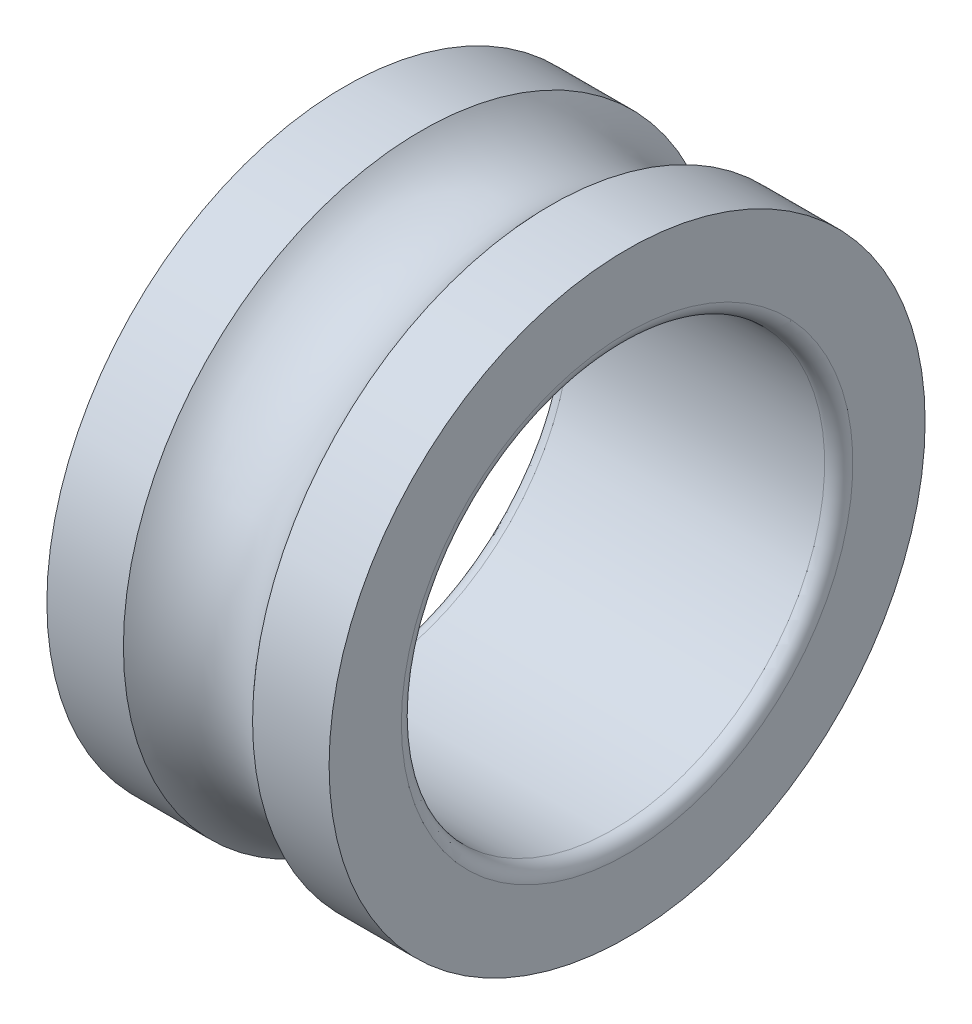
ISO-10303-21;
HEADER;
FILE_DESCRIPTION(('STEP AP214'),'2;1');
FILE_NAME('part.step','',(''),(''),'','','');
FILE_SCHEMA(('AUTOMOTIVE_DESIGN { 1 0 10303 214 1 1 1 1 }'));
ENDSEC;
DATA;
#1=APPLICATION_CONTEXT('core data for automotive mechanical design processes');
#2=APPLICATION_PROTOCOL_DEFINITION('international standard','automotive_design',2000,#1);
#3=PRODUCT_CONTEXT('',#1,'mechanical');
#4=PRODUCT('Part','Part','',(#3));
#5=PRODUCT_RELATED_PRODUCT_CATEGORY('part','',(#4));
#6=PRODUCT_DEFINITION_FORMATION('','',#4);
#7=PRODUCT_DEFINITION_CONTEXT('part definition',#1,'design');
#8=PRODUCT_DEFINITION('design','',#6,#7);
#9=PRODUCT_DEFINITION_SHAPE('','',#8);
#10=(LENGTH_UNIT() NAMED_UNIT(*) SI_UNIT(.MILLI.,.METRE.));
#11=(NAMED_UNIT(*) PLANE_ANGLE_UNIT() SI_UNIT($,.RADIAN.));
#12=(NAMED_UNIT(*) SI_UNIT($,.STERADIAN.) SOLID_ANGLE_UNIT());
#13=UNCERTAINTY_MEASURE_WITH_UNIT(LENGTH_MEASURE(1.E-05),#10,'distance_accuracy_value','');
#14=(GEOMETRIC_REPRESENTATION_CONTEXT(3) GLOBAL_UNCERTAINTY_ASSIGNED_CONTEXT((#13)) GLOBAL_UNIT_ASSIGNED_CONTEXT((#10,
#11,#12)) REPRESENTATION_CONTEXT('',''));
#15=CARTESIAN_POINT('',(0.,0.,0.));
#16=DIRECTION('',(0.,0.,1.));
#17=DIRECTION('',(1.,0.,0.));
#18=AXIS2_PLACEMENT_3D('',#15,#16,#17);
#19=CARTESIAN_POINT('',(8.,0.,0.));
#20=DIRECTION('',(-1.,0.,0.));
#21=DIRECTION('',(0.,0.,1.));
#22=AXIS2_PLACEMENT_3D('',#19,#20,#21);
#23=CYLINDRICAL_SURFACE('',#22,8.448);
#24=CARTESIAN_POINT('',(0.,0.,0.));
#25=DIRECTION('',(-1.,0.,0.));
#26=DIRECTION('',(0.,0.,1.));
#27=AXIS2_PLACEMENT_3D('',#24,#25,#26);
#28=CIRCLE('',#27,8.448);
#29=CARTESIAN_POINT('',(0.,0.,8.448));
#30=VERTEX_POINT('',#29);
#31=EDGE_CURVE('E10',#30,#30,#28,.T.);
#32=ORIENTED_EDGE('',*,*,#31,.F.);
#33=EDGE_LOOP('',(#32));
#34=FACE_BOUND('',#33,.T.);
#35=CARTESIAN_POINT('',(2.16934547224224,0.,0.));
#36=DIRECTION('',(-1.,0.,0.));
#37=DIRECTION('',(0.,0.,1.));
#38=AXIS2_PLACEMENT_3D('',#35,#36,#37);
#39=CIRCLE('',#38,8.448);
#40=CARTESIAN_POINT('',(2.16934547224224,0.,8.448));
#41=VERTEX_POINT('',#40);
#42=EDGE_CURVE('E56',#41,#41,#39,.T.);
#43=ORIENTED_EDGE('',*,*,#42,.T.);
#44=EDGE_LOOP('',(#43));
#45=FACE_BOUND('',#44,.T.);
#46=ADVANCED_FACE('F28',(#34,#45),#23,.T.);
#47=CARTESIAN_POINT('',(0.,8.448,0.));
#48=DIRECTION('',(1.,0.,0.));
#49=DIRECTION('',(0.,0.,-1.));
#50=AXIS2_PLACEMENT_3D('',#47,#48,#49);
#51=PLANE('',#50);
#52=CARTESIAN_POINT('',(0.,0.,0.));
#53=DIRECTION('',(-1.,0.,0.));
#54=DIRECTION('',(0.,0.,1.));
#55=AXIS2_PLACEMENT_3D('',#52,#53,#54);
#56=CIRCLE('',#55,6.4);
#57=CARTESIAN_POINT('',(0.,0.,6.4));
#58=VERTEX_POINT('',#57);
#59=EDGE_CURVE('E34',#58,#58,#56,.T.);
#60=ORIENTED_EDGE('',*,*,#59,.F.);
#61=EDGE_LOOP('',(#60));
#62=FACE_BOUND('',#61,.T.);
#63=ORIENTED_EDGE('',*,*,#31,.T.);
#64=EDGE_LOOP('',(#63));
#65=FACE_BOUND('',#64,.T.);
#66=ADVANCED_FACE('F93',(#62,#65),#51,.F.);
#67=CARTESIAN_POINT('',(0.399999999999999,0.,0.));
#68=DIRECTION('',(-1.,0.,0.));
#69=DIRECTION('',(0.,0.,1.));
#70=AXIS2_PLACEMENT_3D('',#67,#68,#69);
#71=TOROIDAL_SURFACE('',#70,6.4,0.399999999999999);
#72=CARTESIAN_POINT('',(0.399999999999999,0.,0.));
#73=DIRECTION('',(-1.,0.,0.));
#74=DIRECTION('',(0.,0.,1.));
#75=AXIS2_PLACEMENT_3D('',#72,#73,#74);
#76=CIRCLE('',#75,6.);
#77=CARTESIAN_POINT('',(0.399999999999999,0.,6.));
#78=VERTEX_POINT('',#77);
#79=EDGE_CURVE('E38',#78,#78,#76,.T.);
#80=ORIENTED_EDGE('',*,*,#79,.F.);
#81=EDGE_LOOP('',(#80));
#82=FACE_BOUND('',#81,.T.);
#83=ORIENTED_EDGE('',*,*,#59,.T.);
#84=EDGE_LOOP('',(#83));
#85=FACE_BOUND('',#84,.T.);
#86=ADVANCED_FACE('F88',(#82,#85),#71,.T.);
#87=CARTESIAN_POINT('',(8.,0.,0.));
#88=DIRECTION('',(-1.,0.,0.));
#89=DIRECTION('',(0.,0.,1.));
#90=AXIS2_PLACEMENT_3D('',#87,#88,#89);
#91=CYLINDRICAL_SURFACE('',#90,6.);
#92=CARTESIAN_POINT('',(7.6,0.,0.));
#93=DIRECTION('',(-1.,0.,0.));
#94=DIRECTION('',(0.,0.,1.));
#95=AXIS2_PLACEMENT_3D('',#92,#93,#94);
#96=CIRCLE('',#95,6.);
#97=CARTESIAN_POINT('',(7.6,0.,6.));
#98=VERTEX_POINT('',#97);
#99=EDGE_CURVE('E42',#98,#98,#96,.T.);
#100=ORIENTED_EDGE('',*,*,#99,.F.);
#101=EDGE_LOOP('',(#100));
#102=FACE_BOUND('',#101,.T.);
#103=ORIENTED_EDGE('',*,*,#79,.T.);
#104=EDGE_LOOP('',(#103));
#105=FACE_BOUND('',#104,.T.);
#106=ADVANCED_FACE('F82',(#102,#105),#91,.F.);
#107=CARTESIAN_POINT('',(7.6,0.,0.));
#108=DIRECTION('',(-1.,0.,0.));
#109=DIRECTION('',(0.,0.,1.));
#110=AXIS2_PLACEMENT_3D('',#107,#108,#109);
#111=TOROIDAL_SURFACE('',#110,6.4,0.400000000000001);
#112=CARTESIAN_POINT('',(8.,0.,0.));
#113=DIRECTION('',(-1.,0.,0.));
#114=DIRECTION('',(0.,0.,1.));
#115=AXIS2_PLACEMENT_3D('',#112,#113,#114);
#116=CIRCLE('',#115,6.4);
#117=CARTESIAN_POINT('',(8.,0.,6.4));
#118=VERTEX_POINT('',#117);
#119=EDGE_CURVE('E47',#118,#118,#116,.T.);
#120=ORIENTED_EDGE('',*,*,#119,.F.);
#121=EDGE_LOOP('',(#120));
#122=FACE_BOUND('',#121,.T.);
#123=ORIENTED_EDGE('',*,*,#99,.T.);
#124=EDGE_LOOP('',(#123));
#125=FACE_BOUND('',#124,.T.);
#126=ADVANCED_FACE('F76',(#122,#125),#111,.T.);
#127=CARTESIAN_POINT('',(8.,6.4,0.));
#128=DIRECTION('',(-1.,0.,0.));
#129=DIRECTION('',(0.,0.,1.));
#130=AXIS2_PLACEMENT_3D('',#127,#128,#129);
#131=PLANE('',#130);
#132=CARTESIAN_POINT('',(8.,0.,0.));
#133=DIRECTION('',(-1.,0.,0.));
#134=DIRECTION('',(0.,0.,1.));
#135=AXIS2_PLACEMENT_3D('',#132,#133,#134);
#136=CIRCLE('',#135,8.448);
#137=CARTESIAN_POINT('',(8.,0.,8.448));
#138=VERTEX_POINT('',#137);
#139=EDGE_CURVE('E50',#138,#138,#136,.T.);
#140=ORIENTED_EDGE('',*,*,#139,.F.);
#141=EDGE_LOOP('',(#140));
#142=FACE_BOUND('',#141,.T.);
#143=ORIENTED_EDGE('',*,*,#119,.T.);
#144=EDGE_LOOP('',(#143));
#145=FACE_BOUND('',#144,.T.);
#146=ADVANCED_FACE('F70',(#142,#145),#131,.F.);
#147=CARTESIAN_POINT('',(8.,0.,0.));
#148=DIRECTION('',(-1.,0.,0.));
#149=DIRECTION('',(0.,0.,1.));
#150=AXIS2_PLACEMENT_3D('',#147,#148,#149);
#151=CYLINDRICAL_SURFACE('',#150,8.448);
#152=CARTESIAN_POINT('',(5.83065452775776,0.,0.));
#153=DIRECTION('',(-1.,0.,0.));
#154=DIRECTION('',(0.,0.,1.));
#155=AXIS2_PLACEMENT_3D('',#152,#153,#154);
#156=CIRCLE('',#155,8.448);
#157=CARTESIAN_POINT('',(5.83065452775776,0.,8.448));
#158=VERTEX_POINT('',#157);
#159=EDGE_CURVE('E53',#158,#158,#156,.T.);
#160=ORIENTED_EDGE('',*,*,#159,.F.);
#161=EDGE_LOOP('',(#160));
#162=FACE_BOUND('',#161,.T.);
#163=ORIENTED_EDGE('',*,*,#139,.T.);
#164=EDGE_LOOP('',(#163));
#165=FACE_BOUND('',#164,.T.);
#166=ADVANCED_FACE('F64',(#162,#165),#151,.T.);
#167=CARTESIAN_POINT('',(4.,0.,0.));
#168=DIRECTION('',(-1.,0.,0.));
#169=DIRECTION('',(0.,0.,1.));
#170=AXIS2_PLACEMENT_3D('',#167,#168,#169);
#171=TOROIDAL_SURFACE('',#170,10.,2.4);
#172=ORIENTED_EDGE('',*,*,#42,.F.);
#173=EDGE_LOOP('',(#172));
#174=FACE_BOUND('',#173,.T.);
#175=ORIENTED_EDGE('',*,*,#159,.T.);
#176=EDGE_LOOP('',(#175));
#177=FACE_BOUND('',#176,.T.);
#178=ADVANCED_FACE('F61',(#174,#177),#171,.F.);
#179=CLOSED_SHELL('',(#46,#66,#86,#106,#126,#146,#166,#178));
#180=MANIFOLD_SOLID_BREP('B2',#179);
#181=ADVANCED_BREP_SHAPE_REPRESENTATION('',(#18,#180),#14);
#182=SHAPE_DEFINITION_REPRESENTATION(#9,#181);
ENDSEC;
END-ISO-10303-21;
